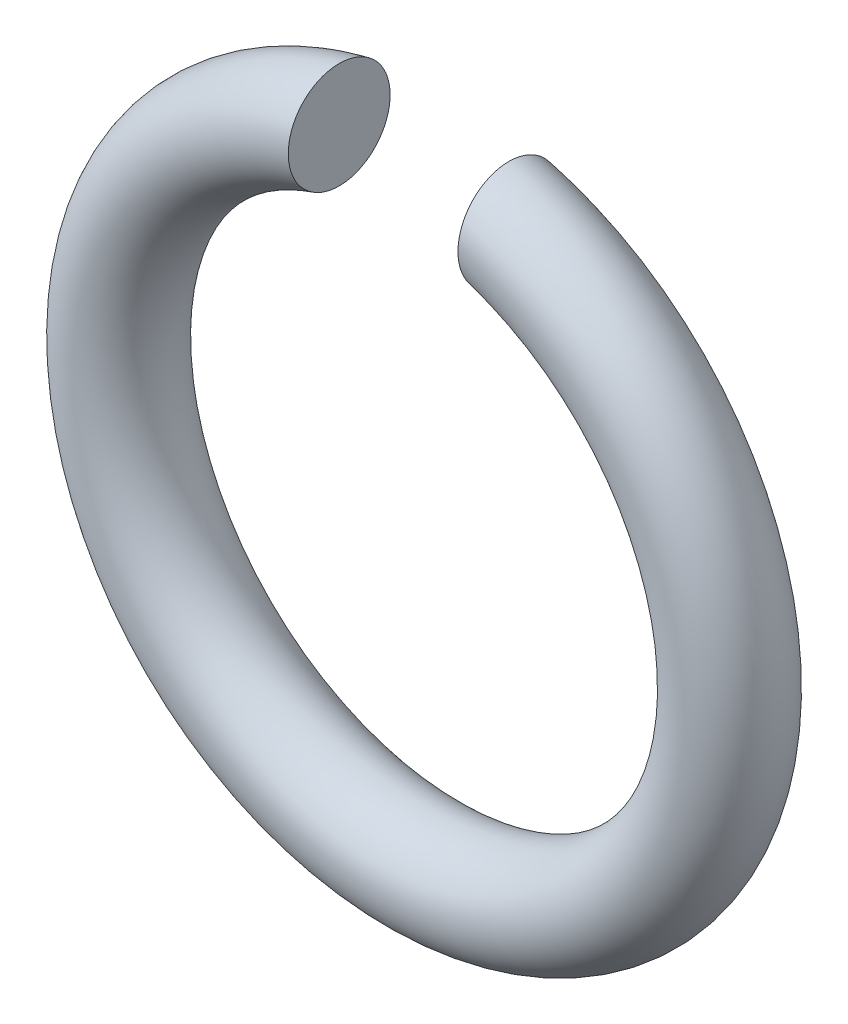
ISO-10303-21;
HEADER;
FILE_DESCRIPTION(('STEP AP214'),'2;1');
FILE_NAME('part.step','',(''),(''),'','','');
FILE_SCHEMA(('AUTOMOTIVE_DESIGN { 1 0 10303 214 1 1 1 1 }'));
ENDSEC;
DATA;
#1=APPLICATION_CONTEXT('core data for automotive mechanical design processes');
#2=APPLICATION_PROTOCOL_DEFINITION('international standard','automotive_design',2000,#1);
#3=PRODUCT_CONTEXT('',#1,'mechanical');
#4=PRODUCT('Part','Part','',(#3));
#5=PRODUCT_RELATED_PRODUCT_CATEGORY('part','',(#4));
#6=PRODUCT_DEFINITION_FORMATION('','',#4);
#7=PRODUCT_DEFINITION_CONTEXT('part definition',#1,'design');
#8=PRODUCT_DEFINITION('design','',#6,#7);
#9=PRODUCT_DEFINITION_SHAPE('','',#8);
#10=(LENGTH_UNIT() NAMED_UNIT(*) SI_UNIT(.MILLI.,.METRE.));
#11=(NAMED_UNIT(*) PLANE_ANGLE_UNIT() SI_UNIT($,.RADIAN.));
#12=(NAMED_UNIT(*) SI_UNIT($,.STERADIAN.) SOLID_ANGLE_UNIT());
#13=UNCERTAINTY_MEASURE_WITH_UNIT(LENGTH_MEASURE(1.E-05),#10,'distance_accuracy_value','');
#14=(GEOMETRIC_REPRESENTATION_CONTEXT(3) GLOBAL_UNCERTAINTY_ASSIGNED_CONTEXT((#13)) GLOBAL_UNIT_ASSIGNED_CONTEXT((#10,
#11,#12)) REPRESENTATION_CONTEXT('',''));
#15=CARTESIAN_POINT('',(0.,0.,0.));
#16=DIRECTION('',(0.,0.,1.));
#17=DIRECTION('',(1.,0.,0.));
#18=AXIS2_PLACEMENT_3D('',#15,#16,#17);
#19=CARTESIAN_POINT('',(0.,0.,0.));
#20=DIRECTION('',(0.,0.,-1.));
#21=DIRECTION('',(-1.,0.,0.));
#22=AXIS2_PLACEMENT_3D('',#19,#20,#21);
#23=TOROIDAL_SURFACE('',#22,1.8,0.3);
#24=CARTESIAN_POINT('',(0.5,1.51136782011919,-0.216115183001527));
#25=CARTESIAN_POINT('',(0.5,1.52465332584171,-0.228257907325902));
#26=CARTESIAN_POINT('',(0.5,1.53900513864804,-0.239258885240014));
#27=CARTESIAN_POINT('',(0.5,1.5693733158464,-0.258695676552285));
#28=CARTESIAN_POINT('',(0.5,1.58539263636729,-0.267126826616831));
#29=CARTESIAN_POINT('',(0.5,1.61858141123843,-0.281198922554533));
#30=CARTESIAN_POINT('',(0.5,1.63574884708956,-0.286844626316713));
#31=CARTESIAN_POINT('',(0.5,1.67077178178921,-0.295228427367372));
#32=CARTESIAN_POINT('',(0.5,1.68862703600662,-0.297967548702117));
#33=CARTESIAN_POINT('',(0.5,1.72486254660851,-0.300486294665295));
#34=CARTESIAN_POINT('',(0.5,1.74324651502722,-0.300213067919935));
#35=CARTESIAN_POINT('',(0.5,1.77970661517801,-0.296561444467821));
#36=CARTESIAN_POINT('',(0.5,1.79778272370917,-0.293182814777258));
#37=CARTESIAN_POINT('',(0.5,1.8329594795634,-0.283414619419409));
#38=CARTESIAN_POINT('',(0.5,1.85006638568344,-0.277047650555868));
#39=CARTESIAN_POINT('',(0.5,1.88292316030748,-0.261451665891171));
#40=CARTESIAN_POINT('',(0.5,1.89867322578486,-0.252223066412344));
#41=CARTESIAN_POINT('',(0.5,1.92789367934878,-0.231432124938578));
#42=CARTESIAN_POINT('',(0.5,1.94141525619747,-0.219941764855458));
#43=CARTESIAN_POINT('',(0.5,1.96625356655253,-0.194783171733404));
#44=CARTESIAN_POINT('',(0.5,1.97757073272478,-0.181115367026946));
#45=CARTESIAN_POINT('',(0.5,1.99727804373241,-0.152484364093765));
#46=CARTESIAN_POINT('',(0.5,2.00575354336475,-0.137579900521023));
#47=CARTESIAN_POINT('',(0.5,2.02000188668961,-0.106530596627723));
#48=CARTESIAN_POINT('',(0.5,2.02577518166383,-0.0903859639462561));
#49=CARTESIAN_POINT('',(0.5,2.03430497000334,-0.0577832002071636));
#50=CARTESIAN_POINT('',(0.5,2.03713839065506,-0.0413451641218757));
#51=CARTESIAN_POINT('',(0.5,2.03996509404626,-0.00822718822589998));
#52=CARTESIAN_POINT('',(0.5,2.03995865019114,0.00845272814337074));
#53=CARTESIAN_POINT('',(0.5,2.03712500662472,0.0413518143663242));
#54=CARTESIAN_POINT('',(0.5,2.03433440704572,0.0575741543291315));
#55=CARTESIAN_POINT('',(0.5,2.02607809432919,0.0893221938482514));
#56=CARTESIAN_POINT('',(0.5,2.02061240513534,0.104847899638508));
#57=CARTESIAN_POINT('',(0.5,2.00715628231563,0.134827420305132));
#58=CARTESIAN_POINT('',(0.5,1.99915710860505,0.149277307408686));
#59=CARTESIAN_POINT('',(0.5,1.98088863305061,0.17666123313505));
#60=CARTESIAN_POINT('',(0.5,1.97061917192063,0.189595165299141));
#61=CARTESIAN_POINT('',(0.5,1.94790499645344,0.213847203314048));
#62=CARTESIAN_POINT('',(0.5,1.93542311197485,0.225130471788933));
#63=CARTESIAN_POINT('',(0.5,1.90878918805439,0.245512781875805));
#64=CARTESIAN_POINT('',(0.5,1.89463692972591,0.254611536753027));
#65=CARTESIAN_POINT('',(0.5,1.86462032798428,0.27065654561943));
#66=CARTESIAN_POINT('',(0.5,1.84871774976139,0.277531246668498));
#67=CARTESIAN_POINT('',(0.5,1.81600810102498,0.288607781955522));
#68=CARTESIAN_POINT('',(0.5,1.799200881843,0.292809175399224));
#69=CARTESIAN_POINT('',(0.5,1.76457657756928,0.298557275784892));
#70=CARTESIAN_POINT('',(0.5,1.74674442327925,0.300013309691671));
#71=CARTESIAN_POINT('',(0.5,1.71108173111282,0.299986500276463));
#72=CARTESIAN_POINT('',(0.5,1.69325119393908,0.298503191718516));
#73=CARTESIAN_POINT('',(0.5,1.65765065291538,0.29257839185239));
#74=CARTESIAN_POINT('',(0.5,1.63989217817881,0.288067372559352));
#75=CARTESIAN_POINT('',(0.5,1.6053797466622,0.276133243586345));
#76=CARTESIAN_POINT('',(0.5,1.58862586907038,0.268709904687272));
#77=CARTESIAN_POINT('',(0.5,1.55659931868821,0.251118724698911));
#78=CARTESIAN_POINT('',(0.5,1.5413282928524,0.240947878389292));
#79=CARTESIAN_POINT('',(0.5,1.51277767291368,0.218111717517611));
#80=CARTESIAN_POINT('',(0.5,1.49949782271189,0.205446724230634));
#81=CARTESIAN_POINT('',(0.5,1.47577203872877,0.178375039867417));
#82=CARTESIAN_POINT('',(0.5,1.46525166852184,0.164033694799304));
#83=CARTESIAN_POINT('',(0.5,1.44692665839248,0.133708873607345));
#84=CARTESIAN_POINT('',(0.5,1.43912103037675,0.117725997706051));
#85=CARTESIAN_POINT('',(0.5,1.42688703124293,0.0854798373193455));
#86=CARTESIAN_POINT('',(0.5,1.42230206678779,0.0692759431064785));
#87=CARTESIAN_POINT('',(0.5,1.41605561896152,0.0363159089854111));
#88=CARTESIAN_POINT('',(0.5,1.41439310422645,0.0195599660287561));
#89=CARTESIAN_POINT('',(0.5,1.41406870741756,-0.0132551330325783));
#90=CARTESIAN_POINT('',(0.5,1.4152805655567,-0.0293131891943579));
#91=CARTESIAN_POINT('',(0.5,1.42039585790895,-0.0609978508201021));
#92=CARTESIAN_POINT('',(0.5,1.42429987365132,-0.076624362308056));
#93=CARTESIAN_POINT('',(0.5,1.4346314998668,-0.106962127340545));
#94=CARTESIAN_POINT('',(0.5,1.44105153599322,-0.121675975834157));
#95=CARTESIAN_POINT('',(0.5,1.45618273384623,-0.149856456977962));
#96=CARTESIAN_POINT('',(0.5,1.46489139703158,-0.163324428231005));
#97=CARTESIAN_POINT('',(0.5,1.48011621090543,-0.183226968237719));
#98=CARTESIAN_POINT('',(0.5,1.48595727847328,-0.190189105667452));
#99=CARTESIAN_POINT('',(0.5,1.49823101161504,-0.203569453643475));
#100=CARTESIAN_POINT('',(0.5,1.50466365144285,-0.209987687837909));
#101=CARTESIAN_POINT('',(0.5,1.51136782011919,-0.216115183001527));
#102=B_SPLINE_CURVE_WITH_KNOTS('',3,(#24,#25,#26,#27,#28,#29,#30,#31,#32,#33,#34,#35,#36,#37,
#38,#39,#40,#41,#42,#43,#44,#45,#46,#47,#48,#49,#50,#51,#52,#53,#54,#55,#56,#57,#58,#59,#60,#61,
#62,#63,#64,#65,#66,#67,#68,#69,#70,#71,#72,#73,#74,#75,#76,#77,#78,#79,#80,#81,#82,#83,#84,#85,
#86,#87,#88,#89,#90,#91,#92,#93,#94,#95,#96,#97,#98,#99,#100,#101),.UNSPECIFIED.,.T.,.F.,(4,2,2,
2,2,2,2,2,2,2,2,2,2,2,2,2,2,2,2,2,2,2,2,2,2,2,2,2,2,2,2,2,2,2,2,2,2,2,4),(0.,0.05396149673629,
0.108020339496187,0.161986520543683,0.215933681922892,0.270828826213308,0.325728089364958,
0.380218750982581,0.434701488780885,0.487670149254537,0.540628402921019,0.59181254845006,
0.642988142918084,0.692788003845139,0.74258307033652,0.791732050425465,0.840880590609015,
0.890200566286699,0.939524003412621,0.989772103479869,1.04002679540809,1.09176654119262,
1.14351481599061,1.19694416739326,1.25038197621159,1.30509092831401,1.35980418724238,
1.41457753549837,1.46934383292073,1.52243012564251,1.57549707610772,1.62576136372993,
1.6760079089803,1.72408846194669,1.77217940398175,1.82012666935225,1.8680218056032,
1.89525319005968,1.9224833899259),.UNSPECIFIED.);
#103=CARTESIAN_POINT('',(0.5,1.51136782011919,-0.216115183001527));
#104=VERTEX_POINT('',#103);
#105=EDGE_CURVE('E50',#104,#104,#102,.T.);
#106=ORIENTED_EDGE('',*,*,#105,.T.);
#107=EDGE_LOOP('',(#106));
#108=FACE_BOUND('',#107,.T.);
#109=CARTESIAN_POINT('',(-0.5,1.51136782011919,-0.216115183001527));
#110=CARTESIAN_POINT('',(-0.5,1.49895807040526,-0.204771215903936));
#111=CARTESIAN_POINT('',(-0.5,1.48746123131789,-0.192415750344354));
#112=CARTESIAN_POINT('',(-0.5,1.46666219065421,-0.165963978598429));
#113=CARTESIAN_POINT('',(-0.5,1.45736144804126,-0.151866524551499));
#114=CARTESIAN_POINT('',(-0.5,1.441276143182,-0.122264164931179));
#115=CARTESIAN_POINT('',(-0.5,1.43449610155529,-0.10675679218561));
#116=CARTESIAN_POINT('',(-0.5,1.42374779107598,-0.0747982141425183));
#117=CARTESIAN_POINT('',(-0.5,1.4197785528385,-0.0583473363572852));
#118=CARTESIAN_POINT('',(-0.5,1.41490545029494,-0.0255886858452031));
#119=CARTESIAN_POINT('',(-0.5,1.41389886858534,-0.00929616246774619));
#120=CARTESIAN_POINT('',(-0.5,1.41469960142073,0.0232184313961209));
#121=CARTESIAN_POINT('',(-0.5,1.4165066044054,0.0394405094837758));
#122=CARTESIAN_POINT('',(-0.5,1.42279316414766,0.0710067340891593));
#123=CARTESIAN_POINT('',(-0.5,1.42721681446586,0.0863620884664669));
#124=CARTESIAN_POINT('',(-0.5,1.43852315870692,0.11613705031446));
#125=CARTESIAN_POINT('',(-0.5,1.44540604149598,0.13055658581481));
#126=CARTESIAN_POINT('',(-0.5,1.46157469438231,0.158416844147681));
#127=CARTESIAN_POINT('',(-0.5,1.47091149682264,0.171827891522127));
#128=CARTESIAN_POINT('',(-0.5,1.49160452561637,0.196987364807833));
#129=CARTESIAN_POINT('',(-0.5,1.50296119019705,0.208735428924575));
#130=CARTESIAN_POINT('',(-0.5,1.52797031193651,0.230855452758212));
#131=CARTESIAN_POINT('',(-0.5,1.54170871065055,0.241130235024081));
#132=CARTESIAN_POINT('',(-0.5,1.57065116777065,0.259351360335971));
#133=CARTESIAN_POINT('',(-0.5,1.58585558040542,0.267297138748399));
#134=CARTESIAN_POINT('',(-0.5,1.61807153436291,0.281009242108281));
#135=CARTESIAN_POINT('',(-0.5,1.63513450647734,0.286654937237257));
#136=CARTESIAN_POINT('',(-0.5,1.66995590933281,0.295074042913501));
#137=CARTESIAN_POINT('',(-0.5,1.68771444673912,0.297847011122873));
#138=CARTESIAN_POINT('',(-0.5,1.72385285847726,0.300471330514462));
#139=CARTESIAN_POINT('',(-0.5,1.74223769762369,0.300255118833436));
#140=CARTESIAN_POINT('',(-0.5,1.77870776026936,0.296717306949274));
#141=CARTESIAN_POINT('',(-0.5,1.79679298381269,0.293395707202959));
#142=CARTESIAN_POINT('',(-0.5,1.83200239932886,0.283738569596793));
#143=CARTESIAN_POINT('',(-0.5,1.84913256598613,0.277424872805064));
#144=CARTESIAN_POINT('',(-0.5,1.88204504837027,0.261930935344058));
#145=CARTESIAN_POINT('',(-0.5,1.89782754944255,0.252751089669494));
#146=CARTESIAN_POINT('',(-0.5,1.92712195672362,0.23204902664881));
#147=CARTESIAN_POINT('',(-0.5,1.94068461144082,0.220598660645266));
#148=CARTESIAN_POINT('',(-0.5,1.96561142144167,0.195512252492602));
#149=CARTESIAN_POINT('',(-0.5,1.97697600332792,0.181876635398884));
#150=CARTESIAN_POINT('',(-0.5,1.99678115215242,0.153300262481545));
#151=CARTESIAN_POINT('',(-0.5,2.00530694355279,0.138418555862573));
#152=CARTESIAN_POINT('',(-0.5,2.01965872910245,0.107405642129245));
#153=CARTESIAN_POINT('',(-0.5,2.02548517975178,0.091274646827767));
#154=CARTESIAN_POINT('',(-0.5,2.0341204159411,0.0586910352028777));
#155=CARTESIAN_POINT('',(-0.5,2.03700638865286,0.0422588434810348));
#156=CARTESIAN_POINT('',(-0.5,2.03993798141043,0.00914350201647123));
#157=CARTESIAN_POINT('',(-0.5,2.03998387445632,-0.00753962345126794));
#158=CARTESIAN_POINT('',(-0.5,2.03725247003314,-0.0404513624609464));
#159=CARTESIAN_POINT('',(-0.5,2.03451220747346,-0.0566830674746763));
#160=CARTESIAN_POINT('',(-0.5,2.02635387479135,-0.0884579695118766));
#161=CARTESIAN_POINT('',(-0.5,2.02093583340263,-0.104001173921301));
#162=CARTESIAN_POINT('',(-0.5,2.00757206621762,-0.134020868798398));
#163=CARTESIAN_POINT('',(-0.5,1.99961796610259,-0.148493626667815));
#164=CARTESIAN_POINT('',(-0.5,1.98143496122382,-0.175930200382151));
#165=CARTESIAN_POINT('',(-0.5,1.97120589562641,-0.188893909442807));
#166=CARTESIAN_POINT('',(-0.5,1.94856895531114,-0.213210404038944));
#167=CARTESIAN_POINT('',(-0.5,1.93612405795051,-0.224528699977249));
#168=CARTESIAN_POINT('',(-0.5,1.90955776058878,-0.244986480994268));
#169=CARTESIAN_POINT('',(-0.5,1.89543613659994,-0.254125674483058));
#170=CARTESIAN_POINT('',(-0.5,1.86547541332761,-0.270256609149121));
#171=CARTESIAN_POINT('',(-0.5,1.84959793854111,-0.277177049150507));
#172=CARTESIAN_POINT('',(-0.5,1.81693133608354,-0.288348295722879));
#173=CARTESIAN_POINT('',(-0.5,1.80014209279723,-0.292598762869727));
#174=CARTESIAN_POINT('',(-0.5,1.76554754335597,-0.298448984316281));
#175=CARTESIAN_POINT('',(-0.5,1.74772694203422,-0.299958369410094));
#176=CARTESIAN_POINT('',(-0.5,1.71207403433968,-0.300039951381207));
#177=CARTESIAN_POINT('',(-0.5,1.69424172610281,-0.298611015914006));
#178=CARTESIAN_POINT('',(-0.5,1.65861951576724,-0.292794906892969));
#179=CARTESIAN_POINT('',(-0.5,1.64084123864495,-0.288336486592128));
#180=CARTESIAN_POINT('',(-0.5,1.60629499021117,-0.276505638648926));
#181=CARTESIAN_POINT('',(-0.5,1.589526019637,-0.269136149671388));
#182=CARTESIAN_POINT('',(-0.5,1.56231310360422,-0.254301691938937));
#183=CARTESIAN_POINT('',(-0.5,1.55148412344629,-0.247532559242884));
#184=CARTESIAN_POINT('',(-0.5,1.53071767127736,-0.232741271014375));
#185=CARTESIAN_POINT('',(-0.5,1.52078016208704,-0.224719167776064));
#186=CARTESIAN_POINT('',(-0.5,1.51136782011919,-0.216115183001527));
#187=B_SPLINE_CURVE_WITH_KNOTS('',3,(#109,#110,#111,#112,#113,#114,#115,#116,#117,#118,#119,
#120,#121,#122,#123,#124,#125,#126,#127,#128,#129,#130,#131,#132,#133,#134,#135,#136,#137,#138,
#139,#140,#141,#142,#143,#144,#145,#146,#147,#148,#149,#150,#151,#152,#153,#154,#155,#156,#157,
#158,#159,#160,#161,#162,#163,#164,#165,#166,#167,#168,#169,#170,#171,#172,#173,#174,#175,#176,
#177,#178,#179,#180,#181,#182,#183,#184,#185,#186),.UNSPECIFIED.,.T.,.F.,(4,2,2,2,2,2,2,2,2,2,2,
2,2,2,2,2,2,2,2,2,2,2,2,2,2,2,2,2,2,2,2,2,2,2,2,2,2,2,4),(0.,0.0503967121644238,
0.100826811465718,0.15134692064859,0.201849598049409,0.250579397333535,0.299303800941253,
0.347022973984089,0.394745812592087,0.443552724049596,0.492370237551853,0.543609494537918,
0.594861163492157,0.648532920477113,0.702212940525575,0.757108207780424,0.812003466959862,
0.866504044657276,0.920997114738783,0.97398217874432,1.02695694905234,1.07815647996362,
1.12934734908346,1.17915686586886,1.22896159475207,1.27811284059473,1.32726355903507,
1.37657828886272,1.42589650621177,1.47613301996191,1.52637625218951,1.5781016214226,
1.62983356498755,1.6832420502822,1.73667112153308,1.79140231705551,1.84607840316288,
1.88430406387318,1.92252812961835),.UNSPECIFIED.);
#188=CARTESIAN_POINT('',(-0.5,1.51136782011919,-0.216115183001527));
#189=VERTEX_POINT('',#188);
#190=EDGE_CURVE('E10',#189,#189,#187,.T.);
#191=ORIENTED_EDGE('',*,*,#190,.T.);
#192=EDGE_LOOP('',(#191));
#193=FACE_BOUND('',#192,.T.);
#194=ADVANCED_FACE('F40',(#108,#193),#23,.T.);
#195=CARTESIAN_POINT('',(0.5,0.,-0.3));
#196=DIRECTION('',(1.,0.,0.));
#197=DIRECTION('',(0.,0.,-1.));
#198=AXIS2_PLACEMENT_3D('',#195,#196,#197);
#199=PLANE('',#198);
#200=ORIENTED_EDGE('',*,*,#105,.F.);
#201=EDGE_LOOP('',(#200));
#202=FACE_BOUND('',#201,.T.);
#203=ADVANCED_FACE('F60',(#202),#199,.F.);
#204=CARTESIAN_POINT('',(-0.5,0.,-0.3));
#205=DIRECTION('',(-1.,0.,0.));
#206=DIRECTION('',(0.,0.,1.));
#207=AXIS2_PLACEMENT_3D('',#204,#205,#206);
#208=PLANE('',#207);
#209=ORIENTED_EDGE('',*,*,#190,.F.);
#210=EDGE_LOOP('',(#209));
#211=FACE_BOUND('',#210,.T.);
#212=ADVANCED_FACE('F58',(#211),#208,.F.);
#213=CLOSED_SHELL('',(#194,#203,#212));
#214=MANIFOLD_SOLID_BREP('B2',#213);
#215=ADVANCED_BREP_SHAPE_REPRESENTATION('',(#18,#214),#14);
#216=SHAPE_DEFINITION_REPRESENTATION(#9,#215);
ENDSEC;
END-ISO-10303-21;
